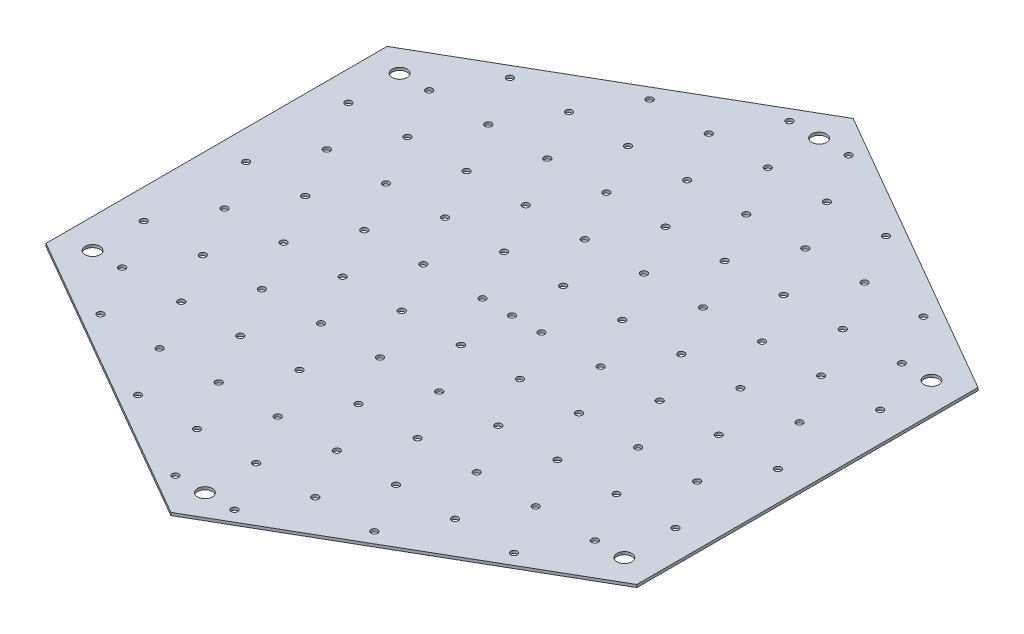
from build123d import *

# Parameters (mm, degrees)
BOSS_EXTRUDE1_DEPTH   = 0.5
SKETCH2_R             = 0.6
CUT_EXTRUDE1_DEPTH    = 83.681240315
BOSS_EXTRUDE2_DEPTH   = 0.5
BOSS_EXTRUDE3_DEPTH   = 0.5
BOSS_EXTRUDE4_DEPTH   = 0.5
SKETCH4_R             = 1.35
CUT_EXTRUDE3_DEPTH    = 83.681240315
SKETCH8_R             = 0.6
CUT_EXTRUDE4_DEPTH    = 83.681240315
SKETCH9_R             = 0.6
CUT_EXTRUDE5_DEPTH    = 83.681240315
SKETCH10_R            = 0.6
CUT_EXTRUDE6_DEPTH    = 83.681240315
SKETCH11_R            = 0.6
CUT_EXTRUDE7_DEPTH    = 83.681240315
SKETCH12_R            = 0.6
CUT_EXTRUDE8_DEPTH    = 83.681240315
SKETCH13_R            = 0.6
CUT_EXTRUDE9_DEPTH    = 83.681240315
SKETCH14_R            = 0.6
CUT_EXTRUDE10_DEPTH   = 83.681240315
SKETCH15_R            = 0.6
CUT_EXTRUDE11_DEPTH   = 83.681240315
SKETCH16_R            = 0.6
CUT_EXTRUDE12_DEPTH   = 83.681240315
SKETCH17_R            = 0.6
CUT_EXTRUDE13_DEPTH   = 83.681240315
LPATTERN3_COUNT       = 5
LPATTERN3_PITCH       = 10.8253
LPATTERN3_COL_COUNT   = 6
LPATTERN3_COL_PITCH   = 10.8253
LPATTERN4_COUNT       = 6
LPATTERN4_PITCH       = 10.8253
LPATTERN4_COL_COUNT   = 5
LPATTERN4_COL_PITCH   = 10.8253
LPATTERN5_COUNT       = 4
LPATTERN5_PITCH       = 10.8253
LPATTERN5_COL_COUNT   = 7
LPATTERN5_COL_PITCH   = 10.8253
LPATTERN6_COUNT       = 3
LPATTERN6_PITCH       = 10.8253
LPATTERN6_COL_COUNT   = 7
LPATTERN6_COL_PITCH   = 10.8253
LPATTERN7_COUNT       = 6
LPATTERN7_PITCH       = 10.8253
LPATTERN8_COUNT       = 5
LPATTERN8_PITCH       = 10.8253
LPATTERN9_COUNT       = 5
LPATTERN9_PITCH       = 10.8253
LPATTERN9_COL_COUNT   = 2
LPATTERN9_COL_PITCH   = 10.8253
LPATTERN10_COUNT      = 4
LPATTERN10_PITCH      = 10.8253
LPATTERN10_COL_COUNT  = 3
LPATTERN10_COL_PITCH  = 10.8253
LPATTERN11_COUNT      = 4
LPATTERN11_PITCH      = 10.8253
LPATTERN11_COL_COUNT  = 3
LPATTERN11_COL_PITCH  = 10.8253
LPATTERN12_COUNT      = 5
LPATTERN12_PITCH      = 10.8253
LPATTERN13_COUNT      = 6
LPATTERN13_PITCH      = 10.8253
LPATTERN14_COUNT      = 6
LPATTERN14_PITCH      = 10.8253
LPATTERN14_COUNT_DIR2 = 5
LPATTERN14_PITCH_DIR2 = 10.8253
LPATTERN15_COUNT      = 7
LPATTERN15_PITCH      = 10.8253
LPATTERN15_COUNT_DIR2 = 4
LPATTERN15_PITCH_DIR2 = 10.8253
LPATTERN16_COUNT      = 7
LPATTERN16_PITCH      = 10.8253
LPATTERN16_COUNT_DIR2 = 3
LPATTERN16_PITCH_DIR2 = 10.8253
LPATTERN17_COUNT      = 6
LPATTERN17_PITCH      = 10.8253
LPATTERN18_COUNT      = 5
LPATTERN18_PITCH      = 10.8253
LPATTERN19_COUNT      = 4
LPATTERN19_PITCH      = 10.8253
LPATTERN20_COUNT      = 3
LPATTERN20_PITCH      = 10.8253


with BuildPart() as part:
    # Sketch1 → Boss-Extrude1 (new body)
    with BuildSketch(Plane(origin=(0, 0, 0), x_dir=(1, 0, 0), z_dir=(0, 1, 0))):
        Polygon((0, 62.5), (-54.126587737, 31.25), (-54.126587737, -31.25), (0, -62.5), (54.126587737, -31.25), (54.126587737, 31.25), align=None)
    extrude(amount=BOSS_EXTRUDE1_DEPTH)

    # Sketch2 → Cut-Extrude1 (cut, through all)
    with BuildSketch(Plane(origin=(0, 0.5, 0), x_dir=(1, 0, 0), z_dir=(0, 1, 0))):
        with Locations(Location((0, 0, 0), (0, 0, 270))):
            Circle(SKETCH2_R)
    extrude(amount=-CUT_EXTRUDE1_DEPTH, mode=Mode.SUBTRACT)

    # Sketch5 → Boss-Extrude2 (add)
    with BuildSketch(Plane(origin=(0, 0.5, 0), x_dir=(1, 0, 0), z_dir=(0, 1, 0))):
        Polygon((-54.126587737, 26.862137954), (3.8, 60.306068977), (0, 62.5), (-54.126587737, 31.25), align=None)
    extrude(amount=-BOSS_EXTRUDE2_DEPTH)

    # Sketch6 → Boss-Extrude3 (add)
    with BuildSketch(Plane(origin=(0, 0.5, 0), x_dir=(1, 0, 0), z_dir=(0, 1, 0))):
        Polygon((54.126587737, 31.25), (54.126587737, 26.862137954), (-3.8, 60.306068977), (0, 62.5), align=None)
    extrude(amount=-BOSS_EXTRUDE3_DEPTH)

    # Sketch7 → Boss-Extrude4 (add)
    with BuildSketch(Plane(origin=(0, 0.5, 0), x_dir=(1, 0, 0), z_dir=(0, 1, 0))):
        Polygon((-54.126587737, -31.25), (-54.126587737, -26.862137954), (0, -58.112137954), (54.126587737, -26.862137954), (54.126587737, -31.25), (0, -62.5), align=None)
    extrude(amount=-BOSS_EXTRUDE4_DEPTH)

    # Sketch4 → Cut-Extrude3 (cut, through all)
    with BuildSketch(Plane(origin=(0, 0.5, 0), x_dir=(1, 0, 0), z_dir=(0, 1, 0))):
        with Locations(Location((0, 56.253070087, 0), (0, 0, 270))):
            Circle(SKETCH4_R)
        with Locations(Location((-48.713928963, 28.125, 0), (0, 0, 270))):
            Circle(SKETCH4_R)
        with Locations(Location((-48.716587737, -28.126535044, 0), (0, 0, 270))):
            Circle(SKETCH4_R)
        with Locations(Location((0, -56.253070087, 0), (0, 0, 270))):
            Circle(SKETCH4_R)
        with Locations(Location((48.716587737, -28.126535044, 0), (0, 0, 270))):
            Circle(SKETCH4_R)
        with Locations(Location((48.716587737, 28.126535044, 0), (0, 0, 270))):
            Circle(SKETCH4_R)
    extrude(amount=-CUT_EXTRUDE3_DEPTH, mode=Mode.SUBTRACT)

    # Sketch8 → Cut-Extrude4 (cut, through all)
    with BuildSketch(Plane(origin=(0, 0.5, 0), x_dir=(1, 0, 0), z_dir=(0, 1, 0))):
        with Locations(Location((5.41265, 0, 0), (0, 0, 270))):
            Circle(SKETCH8_R)
    cut_extrude4 = extrude(amount=-CUT_EXTRUDE4_DEPTH, mode=Mode.SUBTRACT)

    # Sketch9 → Cut-Extrude5 (cut, through all)
    with BuildSketch(Plane(origin=(0, 0.5, 0), x_dir=(1, 0, 0), z_dir=(0, 1, 0))):
        with Locations(Location((16.23795, 0, 0), (0, 0, 270))):
            Circle(SKETCH9_R)
    cut_extrude5 = extrude(amount=-CUT_EXTRUDE5_DEPTH, mode=Mode.SUBTRACT)

    # Sketch10 → Cut-Extrude6 (cut, through all)
    with BuildSketch(Plane(origin=(0, 0.5, 0), x_dir=(1, 0, 0), z_dir=(0, 1, 0))):
        with Locations(Location((27.06325, 0, 0), (0, 0, 270))):
            Circle(SKETCH10_R)
    cut_extrude6 = extrude(amount=-CUT_EXTRUDE6_DEPTH, mode=Mode.SUBTRACT)

    # Sketch11 → Cut-Extrude7 (cut, through all)
    with BuildSketch(Plane(origin=(0, 0.5, 0), x_dir=(1, 0, 0), z_dir=(0, 1, 0))):
        with Locations(Location((37.88855, 0, 0), (0, 0, 270))):
            Circle(SKETCH11_R)
    cut_extrude7 = extrude(amount=-CUT_EXTRUDE7_DEPTH, mode=Mode.SUBTRACT)

    # Sketch12 → Cut-Extrude8 (cut, through all)
    with BuildSketch(Plane(origin=(0, 0.5, 0), x_dir=(1, 0, 0), z_dir=(0, 1, 0))):
        with Locations(Location((48.71385, 0, 0), (0, 0, 270))):
            Circle(SKETCH12_R)
    cut_extrude8 = extrude(amount=-CUT_EXTRUDE8_DEPTH, mode=Mode.SUBTRACT)

    # Sketch13 → Cut-Extrude9 (cut, through all)
    with BuildSketch(Plane(origin=(0, 0.5, 0), x_dir=(1, 0, 0), z_dir=(0, 1, 0))):
        with Locations(Location((-5.41265, 0, 0), (0, 0, 270))):
            Circle(SKETCH13_R)
    cut_extrude9 = extrude(amount=-CUT_EXTRUDE9_DEPTH, mode=Mode.SUBTRACT)

    # Sketch14 → Cut-Extrude10 (cut, through all)
    with BuildSketch(Plane(origin=(0, 0.5, 0), x_dir=(1, 0, 0), z_dir=(0, 1, 0))):
        with Locations(Location((-16.23795, 0, 0), (0, 0, 270))):
            Circle(SKETCH14_R)
    cut_extrude10 = extrude(amount=-CUT_EXTRUDE10_DEPTH, mode=Mode.SUBTRACT)

    # Sketch15 → Cut-Extrude11 (cut, through all)
    with BuildSketch(Plane(origin=(0, 0.5, 0), x_dir=(1, 0, 0), z_dir=(0, 1, 0))):
        with Locations(Location((-27.06325, 0, 0), (0, 0, 270))):
            Circle(SKETCH15_R)
    cut_extrude11 = extrude(amount=-CUT_EXTRUDE11_DEPTH, mode=Mode.SUBTRACT)

    # Sketch16 → Cut-Extrude12 (cut, through all)
    with BuildSketch(Plane(origin=(0, 0.5, 0), x_dir=(1, 0, 0), z_dir=(0, 1, 0))):
        with Locations(Location((-37.88855, 0, 0), (0, 0, 270))):
            Circle(SKETCH16_R)
    cut_extrude12 = extrude(amount=-CUT_EXTRUDE12_DEPTH, mode=Mode.SUBTRACT)

    # Sketch17 → Cut-Extrude13 (cut, through all)
    with BuildSketch(Plane(origin=(0, 0.5, 0), x_dir=(1, 0, 0), z_dir=(0, 1, 0))):
        with Locations(Location((-48.71385, 0, 0), (0, 0, 270))):
            Circle(SKETCH17_R)
    cut_extrude13 = extrude(amount=-CUT_EXTRUDE13_DEPTH, mode=Mode.SUBTRACT)

    # LPattern3: Cut-Extrude4 ×5
    with Locations(*[Vector(0.4999999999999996, 0, 0.8660254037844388) * (i * LPATTERN3_PITCH) for i in range(1, LPATTERN3_COUNT)]):
        add(cut_extrude4, mode=Mode.SUBTRACT)

    # LPattern3 col: Cut-Extrude4 ×6
    with Locations(*[Vector(-0.4999999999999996, 0, -0.8660254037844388) * (i * LPATTERN3_COL_PITCH) for i in range(1, LPATTERN3_COL_COUNT)]):
        add(cut_extrude4, mode=Mode.SUBTRACT)

    # LPattern4: Cut-Extrude5 ×6
    with Locations(*[Vector(-0.4999999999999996, 0, -0.8660254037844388) * (i * LPATTERN4_PITCH) for i in range(1, LPATTERN4_COUNT)]):
        add(cut_extrude5, mode=Mode.SUBTRACT)

    # LPattern4 col: Cut-Extrude5 ×5
    with Locations(*[Vector(0.4999999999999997, 0, 0.8660254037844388) * (i * LPATTERN4_COL_PITCH) for i in range(1, LPATTERN4_COL_COUNT)]):
        add(cut_extrude5, mode=Mode.SUBTRACT)

    # LPattern5: Cut-Extrude6 ×4
    with Locations(*[Vector(0.4999999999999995, 0, 0.8660254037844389) * (i * LPATTERN5_PITCH) for i in range(1, LPATTERN5_COUNT)]):
        add(cut_extrude6, mode=Mode.SUBTRACT)

    # LPattern5 col: Cut-Extrude6 ×7
    with Locations(*[Vector(-0.4999999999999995, 0, -0.8660254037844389) * (i * LPATTERN5_COL_PITCH) for i in range(1, LPATTERN5_COL_COUNT)]):
        add(cut_extrude6, mode=Mode.SUBTRACT)

    # LPattern6: Cut-Extrude7 ×3
    with Locations(*[Vector(0.4999999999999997, 0, 0.8660254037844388) * (i * LPATTERN6_PITCH) for i in range(1, LPATTERN6_COUNT)]):
        add(cut_extrude7, mode=Mode.SUBTRACT)

    # LPattern6 col: Cut-Extrude7 ×7
    with Locations(*[Vector(-0.4999999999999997, 0, -0.8660254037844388) * (i * LPATTERN6_COL_PITCH) for i in range(1, LPATTERN6_COL_COUNT)]):
        add(cut_extrude7, mode=Mode.SUBTRACT)

    # LPattern7: Cut-Extrude8 ×6
    with Locations(*[Vector(-0.4999999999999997, 0, -0.8660254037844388) * (i * LPATTERN7_PITCH) for i in range(1, LPATTERN7_COUNT)]):
        add(cut_extrude8, mode=Mode.SUBTRACT)

    # LPattern8: Cut-Extrude9 ×5
    with Locations(*[Vector(-0.4999999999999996, 0, 0.8660254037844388) * (i * LPATTERN8_PITCH) for i in range(1, LPATTERN8_COUNT)]):
        add(cut_extrude9, mode=Mode.SUBTRACT)

    # LPattern9: Cut-Extrude10 ×5
    with Locations(*[Vector(-0.4999999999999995, 0, 0.8660254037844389) * (i * LPATTERN9_PITCH) for i in range(1, LPATTERN9_COUNT)]):
        add(cut_extrude10, mode=Mode.SUBTRACT)

    # LPattern9 col: Cut-Extrude10 ×2
    with Locations(*[Vector(0.4999999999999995, 0, -0.8660254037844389) * (i * LPATTERN9_COL_PITCH) for i in range(1, LPATTERN9_COL_COUNT)]):
        add(cut_extrude10, mode=Mode.SUBTRACT)

    # LPattern10: Cut-Extrude11 ×4
    with Locations(*[Vector(-0.4999999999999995, 0, 0.8660254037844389) * (i * LPATTERN10_PITCH) for i in range(1, LPATTERN10_COUNT)]):
        add(cut_extrude11, mode=Mode.SUBTRACT)

    # LPattern10 col: Cut-Extrude11 ×3
    with Locations(*[Vector(0.4999999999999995, 0, -0.8660254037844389) * (i * LPATTERN10_COL_PITCH) for i in range(1, LPATTERN10_COL_COUNT)]):
        add(cut_extrude11, mode=Mode.SUBTRACT)

    # LPattern11: Cut-Extrude12 ×4
    with Locations(*[Vector(0.4999999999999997, 0, -0.8660254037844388) * (i * LPATTERN11_PITCH) for i in range(1, LPATTERN11_COUNT)]):
        add(cut_extrude12, mode=Mode.SUBTRACT)

    # LPattern11 col: Cut-Extrude12 ×3
    with Locations(*[Vector(-0.4999999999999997, 0, 0.8660254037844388) * (i * LPATTERN11_COL_PITCH) for i in range(1, LPATTERN11_COL_COUNT)]):
        add(cut_extrude12, mode=Mode.SUBTRACT)

    # LPattern12: Cut-Extrude13 ×5
    with Locations(*[Vector(0.4999999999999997, 0, -0.8660254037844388) * (i * LPATTERN12_PITCH) for i in range(1, LPATTERN12_COUNT)]):
        add(cut_extrude13, mode=Mode.SUBTRACT)

    # LPattern13: Cut-Extrude9 ×6
    with Locations(*[Vector(0.4999999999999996, 0, 0.8660254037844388) * (i * LPATTERN13_PITCH) for i in range(1, LPATTERN13_COUNT)]):
        add(cut_extrude9, mode=Mode.SUBTRACT)

    # LPattern14: Cut-Extrude10 6 × 5
    with Locations(*[Vector(0.4999999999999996, 0, 0.8660254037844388) * (i * LPATTERN14_PITCH) + Vector(-0.4999999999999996, 0, -0.8660254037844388) * (j * LPATTERN14_PITCH_DIR2) for i in range(LPATTERN14_COUNT) for j in range(LPATTERN14_COUNT_DIR2) if (i, j) != (0, 0)]):
        add(cut_extrude10, mode=Mode.SUBTRACT)

    # LPattern15: Cut-Extrude11 7 × 4
    with Locations(*[Vector(0.4999999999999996, 0, 0.8660254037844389) * (i * LPATTERN15_PITCH) + Vector(-0.4999999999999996, 0, -0.8660254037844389) * (j * LPATTERN15_PITCH_DIR2) for i in range(LPATTERN15_COUNT) for j in range(LPATTERN15_COUNT_DIR2) if (i, j) != (0, 0)]):
        add(cut_extrude11, mode=Mode.SUBTRACT)

    # LPattern16: Cut-Extrude12 7 × 3
    with Locations(*[Vector(0.4999999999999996, 0, 0.8660254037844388) * (i * LPATTERN16_PITCH) + Vector(-0.4999999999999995, 0, -0.8660254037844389) * (j * LPATTERN16_PITCH_DIR2) for i in range(LPATTERN16_COUNT) for j in range(LPATTERN16_COUNT_DIR2) if (i, j) != (0, 0)]):
        add(cut_extrude12, mode=Mode.SUBTRACT)

    # LPattern17: Cut-Extrude13 ×6
    with Locations(*[Vector(0.49999999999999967, 0, 0.8660254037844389) * (i * LPATTERN17_PITCH) for i in range(1, LPATTERN17_COUNT)]):
        add(cut_extrude13, mode=Mode.SUBTRACT)

    # LPattern18: Cut-Extrude5 ×5
    with Locations(*[Vector(0.4999999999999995, 0, -0.8660254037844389) * (i * LPATTERN18_PITCH) for i in range(1, LPATTERN18_COUNT)]):
        add(cut_extrude5, mode=Mode.SUBTRACT)

    # LPattern19: Cut-Extrude6 ×4
    with Locations(*[Vector(0.4999999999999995, 0, -0.866025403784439) * (i * LPATTERN19_PITCH) for i in range(1, LPATTERN19_COUNT)]):
        add(cut_extrude6, mode=Mode.SUBTRACT)

    # LPattern20: Cut-Extrude7 ×3
    with Locations(*[Vector(0.4999999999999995, 0, -0.8660254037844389) * (i * LPATTERN20_PITCH) for i in range(1, LPATTERN20_COUNT)]):
        add(cut_extrude7, mode=Mode.SUBTRACT)


solid = part.part
